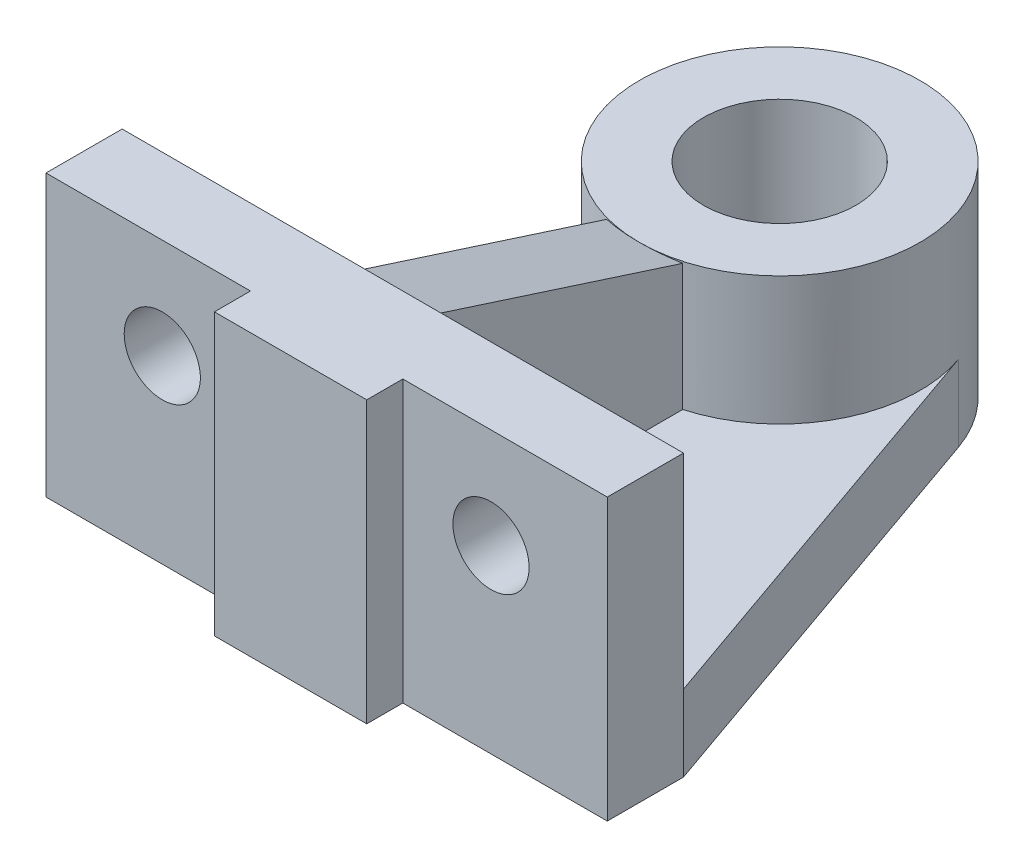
ISO-10303-21;
HEADER;
FILE_DESCRIPTION(('STEP AP214'),'2;1');
FILE_NAME('part.step','',(''),(''),'','','');
FILE_SCHEMA(('AUTOMOTIVE_DESIGN { 1 0 10303 214 1 1 1 1 }'));
ENDSEC;
DATA;
#1=APPLICATION_CONTEXT('core data for automotive mechanical design processes');
#2=APPLICATION_PROTOCOL_DEFINITION('international standard','automotive_design',2000,#1);
#3=PRODUCT_CONTEXT('',#1,'mechanical');
#4=PRODUCT('Part','Part','',(#3));
#5=PRODUCT_RELATED_PRODUCT_CATEGORY('part','',(#4));
#6=PRODUCT_DEFINITION_FORMATION('','',#4);
#7=PRODUCT_DEFINITION_CONTEXT('part definition',#1,'design');
#8=PRODUCT_DEFINITION('design','',#6,#7);
#9=PRODUCT_DEFINITION_SHAPE('','',#8);
#10=(LENGTH_UNIT() NAMED_UNIT(*) SI_UNIT(.MILLI.,.METRE.));
#11=(NAMED_UNIT(*) PLANE_ANGLE_UNIT() SI_UNIT($,.RADIAN.));
#12=(NAMED_UNIT(*) SI_UNIT($,.STERADIAN.) SOLID_ANGLE_UNIT());
#13=UNCERTAINTY_MEASURE_WITH_UNIT(LENGTH_MEASURE(1.E-05),#10,'distance_accuracy_value','');
#14=(GEOMETRIC_REPRESENTATION_CONTEXT(3) GLOBAL_UNCERTAINTY_ASSIGNED_CONTEXT((#13)) GLOBAL_UNIT_ASSIGNED_CONTEXT((#10,
#11,#12)) REPRESENTATION_CONTEXT('',''));
#15=CARTESIAN_POINT('',(0.,0.,0.));
#16=DIRECTION('',(0.,0.,1.));
#17=DIRECTION('',(1.,0.,0.));
#18=AXIS2_PLACEMENT_3D('',#15,#16,#17);
#19=CARTESIAN_POINT('',(0.,19.,0.));
#20=DIRECTION('',(0.,1.,0.));
#21=DIRECTION('',(0.,0.,1.));
#22=AXIS2_PLACEMENT_3D('',#19,#20,#21);
#23=PLANE('',#22);
#24=CARTESIAN_POINT('',(0.,19.,0.));
#25=DIRECTION('',(0.,1.,0.));
#26=DIRECTION('',(0.,0.,1.));
#27=AXIS2_PLACEMENT_3D('',#24,#25,#26);
#28=CIRCLE('',#27,35.);
#29=CARTESIAN_POINT('',(9.5,19.,33.686050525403));
#30=VERTEX_POINT('',#29);
#31=CARTESIAN_POINT('',(33.0332697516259,19.,-11.5673285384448));
#32=VERTEX_POINT('',#31);
#33=EDGE_CURVE('E44',#30,#32,#28,.T.);
#34=ORIENTED_EDGE('',*,*,#33,.F.);
#35=DIRECTION('',(0.,0.,-1.));
#36=VECTOR('',#35,1.);
#37=CARTESIAN_POINT('',(9.5,19.,35.));
#38=LINE('',#37,#36);
#39=CARTESIAN_POINT('',(9.49999999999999,19.,94.));
#40=VERTEX_POINT('',#39);
#41=EDGE_CURVE('E183',#40,#30,#38,.T.);
#42=ORIENTED_EDGE('',*,*,#41,.F.);
#43=DIRECTION('',(1.,0.,0.));
#44=VECTOR('',#43,1.);
#45=CARTESIAN_POINT('',(-70.,19.,94.));
#46=LINE('',#45,#44);
#47=CARTESIAN_POINT('',(70.,19.,94.));
#48=VERTEX_POINT('',#47);
#49=EDGE_CURVE('E233',#40,#48,#46,.T.);
#50=ORIENTED_EDGE('',*,*,#49,.T.);
#51=DIRECTION('',(-0.330495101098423,0.,-0.943807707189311));
#52=VECTOR('',#51,1.);
#53=CARTESIAN_POINT('',(70.,19.,94.));
#54=LINE('',#53,#52);
#55=EDGE_CURVE('E257',#48,#32,#54,.T.);
#56=ORIENTED_EDGE('',*,*,#55,.T.);
#57=EDGE_LOOP('',(#34,#42,#50,#56));
#58=FACE_BOUND('',#57,.T.);
#59=ADVANCED_FACE('F35',(#58),#23,.T.);
#60=CARTESIAN_POINT('',(0.,19.,0.));
#61=DIRECTION('',(0.,-1.,0.));
#62=DIRECTION('',(0.,0.,-1.));
#63=AXIS2_PLACEMENT_3D('',#60,#61,#62);
#64=CYLINDRICAL_SURFACE('',#63,35.);
#65=DIRECTION('',(0.,-1.,0.));
#66=VECTOR('',#65,1.);
#67=CARTESIAN_POINT('',(9.5,19.,33.6860505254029));
#68=LINE('',#67,#66);
#69=CARTESIAN_POINT('',(9.5,50.5768637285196,33.6860505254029));
#70=VERTEX_POINT('',#69);
#71=EDGE_CURVE('E191',#30,#70,#68,.F.);
#72=ORIENTED_EDGE('',*,*,#71,.F.);
#73=ORIENTED_EDGE('',*,*,#33,.T.);
#74=DIRECTION('',(0.,-1.,0.));
#75=VECTOR('',#74,1.);
#76=CARTESIAN_POINT('',(33.0332697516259,19.,-11.5673285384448));
#77=LINE('',#76,#75);
#78=CARTESIAN_POINT('',(33.0332697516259,0.,-11.5673285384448));
#79=VERTEX_POINT('',#78);
#80=EDGE_CURVE('E261',#32,#79,#77,.T.);
#81=ORIENTED_EDGE('',*,*,#80,.T.);
#82=CARTESIAN_POINT('',(0.,0.,0.));
#83=DIRECTION('',(0.,1.,0.));
#84=DIRECTION('',(0.,0.,1.));
#85=AXIS2_PLACEMENT_3D('',#82,#83,#84);
#86=CIRCLE('',#85,35.);
#87=CARTESIAN_POINT('',(-33.0332697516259,0.,-11.5673285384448));
#88=VERTEX_POINT('',#87);
#89=EDGE_CURVE('E254',#79,#88,#86,.T.);
#90=ORIENTED_EDGE('',*,*,#89,.T.);
#91=DIRECTION('',(0.,-1.,0.));
#92=VECTOR('',#91,1.);
#93=CARTESIAN_POINT('',(-33.0332697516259,19.,-11.5673285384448));
#94=LINE('',#93,#92);
#95=CARTESIAN_POINT('',(-33.0332697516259,19.,-11.5673285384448));
#96=VERTEX_POINT('',#95);
#97=EDGE_CURVE('E39',#96,#88,#94,.T.);
#98=ORIENTED_EDGE('',*,*,#97,.F.);
#99=CARTESIAN_POINT('',(-9.5,19.,33.686050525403));
#100=VERTEX_POINT('',#99);
#101=EDGE_CURVE('E11',#96,#100,#28,.T.);
#102=ORIENTED_EDGE('',*,*,#101,.T.);
#103=DIRECTION('',(0.,-1.,0.));
#104=VECTOR('',#103,1.);
#105=CARTESIAN_POINT('',(-9.5,19.,33.6860505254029));
#106=LINE('',#105,#104);
#107=CARTESIAN_POINT('',(-9.5,50.5768637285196,33.686050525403));
#108=VERTEX_POINT('',#107);
#109=EDGE_CURVE('E58',#100,#108,#106,.F.);
#110=ORIENTED_EDGE('',*,*,#109,.T.);
#111=CARTESIAN_POINT('',(0.,39.728813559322,0.));
#112=DIRECTION('',(0.,-0.951860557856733,0.306531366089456));
#113=DIRECTION('',(0.,-0.306531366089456,-0.951860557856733));
#114=AXIS2_PLACEMENT_3D('',#111,#112,#113);
#115=ELLIPSE('',#114,36.7700917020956,35.);
#116=CARTESIAN_POINT('',(0.,51.,35.));
#117=VERTEX_POINT('',#116);
#118=EDGE_CURVE('E177',#117,#108,#115,.T.);
#119=ORIENTED_EDGE('',*,*,#118,.F.);
#120=CARTESIAN_POINT('',(0.,51.,0.));
#121=DIRECTION('',(0.,1.,0.));
#122=DIRECTION('',(0.,0.,1.));
#123=AXIS2_PLACEMENT_3D('',#120,#121,#122);
#124=CIRCLE('',#123,35.);
#125=EDGE_CURVE('E248',#117,#117,#124,.T.);
#126=ORIENTED_EDGE('',*,*,#125,.F.);
#127=EDGE_CURVE('E52',#70,#117,#115,.T.);
#128=ORIENTED_EDGE('',*,*,#127,.F.);
#129=EDGE_LOOP('',(#72,#73,#81,#90,#98,#102,#110,#119,#126,#128));
#130=FACE_BOUND('',#129,.T.);
#131=ADVANCED_FACE('F37',(#130),#64,.T.);
#132=CARTESIAN_POINT('',(0.,0.,94.));
#133=DIRECTION('',(0.,0.,-1.));
#134=DIRECTION('',(-1.,0.,0.));
#135=AXIS2_PLACEMENT_3D('',#132,#133,#134);
#136=PLANE('',#135);
#137=CARTESIAN_POINT('',(41.,45.,94.));
#138=DIRECTION('',(0.,0.,-1.));
#139=DIRECTION('',(-1.,0.,0.));
#140=AXIS2_PLACEMENT_3D('',#137,#138,#139);
#141=CIRCLE('',#140,9.5);
#142=CARTESIAN_POINT('',(31.5,45.,94.));
#143=VERTEX_POINT('',#142);
#144=EDGE_CURVE('E198',#143,#143,#141,.T.);
#145=ORIENTED_EDGE('',*,*,#144,.F.);
#146=EDGE_LOOP('',(#145));
#147=FACE_BOUND('',#146,.T.);
#148=ORIENTED_EDGE('',*,*,#49,.F.);
#149=DIRECTION('',(0.,-1.,0.));
#150=VECTOR('',#149,1.);
#151=CARTESIAN_POINT('',(9.5,19.,94.));
#152=LINE('',#151,#150);
#153=CARTESIAN_POINT('',(9.49999999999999,70.,94.));
#154=VERTEX_POINT('',#153);
#155=EDGE_CURVE('E160',#154,#40,#152,.T.);
#156=ORIENTED_EDGE('',*,*,#155,.F.);
#157=DIRECTION('',(-1.,0.,0.));
#158=VECTOR('',#157,1.);
#159=CARTESIAN_POINT('',(-70.,70.,94.));
#160=LINE('',#159,#158);
#161=CARTESIAN_POINT('',(70.,70.,94.));
#162=VERTEX_POINT('',#161);
#163=EDGE_CURVE('E155',#162,#154,#160,.T.);
#164=ORIENTED_EDGE('',*,*,#163,.F.);
#165=DIRECTION('',(0.,1.,0.));
#166=VECTOR('',#165,1.);
#167=CARTESIAN_POINT('',(70.,19.,94.));
#168=LINE('',#167,#166);
#169=EDGE_CURVE('E172',#48,#162,#168,.T.);
#170=ORIENTED_EDGE('',*,*,#169,.F.);
#171=EDGE_LOOP('',(#148,#156,#164,#170));
#172=FACE_BOUND('',#171,.T.);
#173=ADVANCED_FACE('F306',(#147,#172),#136,.T.);
#174=CARTESIAN_POINT('',(-70.,19.,113.));
#175=DIRECTION('',(0.,0.,-1.));
#176=DIRECTION('',(-1.,0.,0.));
#177=AXIS2_PLACEMENT_3D('',#174,#175,#176);
#178=PLANE('',#177);
#179=CARTESIAN_POINT('',(41.,45.,113.));
#180=DIRECTION('',(0.,0.,-1.));
#181=DIRECTION('',(-1.,0.,0.));
#182=AXIS2_PLACEMENT_3D('',#179,#180,#181);
#183=CIRCLE('',#182,9.5);
#184=CARTESIAN_POINT('',(31.5,45.,113.));
#185=VERTEX_POINT('',#184);
#186=EDGE_CURVE('E194',#185,#185,#183,.T.);
#187=ORIENTED_EDGE('',*,*,#186,.T.);
#188=EDGE_LOOP('',(#187));
#189=FACE_BOUND('',#188,.T.);
#190=DIRECTION('',(0.,1.,0.));
#191=VECTOR('',#190,1.);
#192=CARTESIAN_POINT('',(19.,-39.0512483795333,113.));
#193=LINE('',#192,#191);
#194=CARTESIAN_POINT('',(19.,0.,113.));
#195=VERTEX_POINT('',#194);
#196=CARTESIAN_POINT('',(19.,70.,113.));
#197=VERTEX_POINT('',#196);
#198=EDGE_CURVE('E224',#195,#197,#193,.T.);
#199=ORIENTED_EDGE('',*,*,#198,.F.);
#200=DIRECTION('',(1.,0.,0.));
#201=VECTOR('',#200,1.);
#202=CARTESIAN_POINT('',(-70.,0.,113.));
#203=LINE('',#202,#201);
#204=CARTESIAN_POINT('',(70.,0.,113.));
#205=VERTEX_POINT('',#204);
#206=EDGE_CURVE('E268',#195,#205,#203,.T.);
#207=ORIENTED_EDGE('',*,*,#206,.T.);
#208=DIRECTION('',(0.,-1.,0.));
#209=VECTOR('',#208,1.);
#210=CARTESIAN_POINT('',(70.,19.,113.));
#211=LINE('',#210,#209);
#212=CARTESIAN_POINT('',(70.,70.,113.));
#213=VERTEX_POINT('',#212);
#214=EDGE_CURVE('E279',#213,#205,#211,.T.);
#215=ORIENTED_EDGE('',*,*,#214,.F.);
#216=DIRECTION('',(-1.,0.,0.));
#217=VECTOR('',#216,1.);
#218=CARTESIAN_POINT('',(-70.,70.,113.));
#219=LINE('',#218,#217);
#220=EDGE_CURVE('E234',#213,#197,#219,.T.);
#221=ORIENTED_EDGE('',*,*,#220,.T.);
#222=EDGE_LOOP('',(#199,#207,#215,#221));
#223=FACE_BOUND('',#222,.T.);
#224=ADVANCED_FACE('F340',(#189,#223),#178,.F.);
#225=DIRECTION('',(0.,0.,-1.));
#226=VECTOR('',#225,1.);
#227=CARTESIAN_POINT('',(-9.5,19.,19.));
#228=LINE('',#227,#226);
#229=CARTESIAN_POINT('',(-9.5,19.,94.));
#230=VERTEX_POINT('',#229);
#231=EDGE_CURVE('E179',#230,#100,#228,.T.);
#232=ORIENTED_EDGE('',*,*,#231,.T.);
#233=ORIENTED_EDGE('',*,*,#101,.F.);
#234=DIRECTION('',(-0.330495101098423,0.,0.943807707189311));
#235=VECTOR('',#234,1.);
#236=CARTESIAN_POINT('',(-70.,19.,94.));
#237=LINE('',#236,#235);
#238=CARTESIAN_POINT('',(-70.,19.,94.));
#239=VERTEX_POINT('',#238);
#240=EDGE_CURVE('E255',#96,#239,#237,.T.);
#241=ORIENTED_EDGE('',*,*,#240,.T.);
#242=EDGE_CURVE('E235',#239,#230,#46,.T.);
#243=ORIENTED_EDGE('',*,*,#242,.T.);
#244=EDGE_LOOP('',(#232,#233,#241,#243));
#245=FACE_BOUND('',#244,.T.);
#246=ADVANCED_FACE('F312',(#245),#23,.T.);
#247=CARTESIAN_POINT('',(0.,0.,0.));
#248=DIRECTION('',(0.,1.,0.));
#249=DIRECTION('',(0.,0.,1.));
#250=AXIS2_PLACEMENT_3D('',#247,#248,#249);
#251=PLANE('',#250);
#252=ORIENTED_EDGE('',*,*,#89,.F.);
#253=DIRECTION('',(-0.330495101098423,0.,-0.943807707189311));
#254=VECTOR('',#253,1.);
#255=CARTESIAN_POINT('',(70.,0.,94.));
#256=LINE('',#255,#254);
#257=CARTESIAN_POINT('',(70.,0.,94.));
#258=VERTEX_POINT('',#257);
#259=EDGE_CURVE('E258',#258,#79,#256,.T.);
#260=ORIENTED_EDGE('',*,*,#259,.F.);
#261=DIRECTION('',(0.,0.,-1.));
#262=VECTOR('',#261,1.);
#263=CARTESIAN_POINT('',(70.,0.,113.));
#264=LINE('',#263,#262);
#265=EDGE_CURVE('E271',#205,#258,#264,.T.);
#266=ORIENTED_EDGE('',*,*,#265,.F.);
#267=ORIENTED_EDGE('',*,*,#206,.F.);
#268=DIRECTION('',(0.,0.,1.));
#269=VECTOR('',#268,1.);
#270=CARTESIAN_POINT('',(19.,0.,113.));
#271=LINE('',#270,#269);
#272=CARTESIAN_POINT('',(19.,0.,122.));
#273=VERTEX_POINT('',#272);
#274=EDGE_CURVE('E213',#195,#273,#271,.T.);
#275=ORIENTED_EDGE('',*,*,#274,.T.);
#276=DIRECTION('',(-1.,0.,0.));
#277=VECTOR('',#276,1.);
#278=CARTESIAN_POINT('',(19.,0.,122.));
#279=LINE('',#278,#277);
#280=CARTESIAN_POINT('',(-19.,0.,122.));
#281=VERTEX_POINT('',#280);
#282=EDGE_CURVE('E210',#273,#281,#279,.T.);
#283=ORIENTED_EDGE('',*,*,#282,.T.);
#284=DIRECTION('',(0.,0.,-1.));
#285=VECTOR('',#284,1.);
#286=CARTESIAN_POINT('',(-19.,0.,113.));
#287=LINE('',#286,#285);
#288=CARTESIAN_POINT('',(-19.,0.,113.));
#289=VERTEX_POINT('',#288);
#290=EDGE_CURVE('E207',#281,#289,#287,.T.);
#291=ORIENTED_EDGE('',*,*,#290,.T.);
#292=CARTESIAN_POINT('',(-70.,0.,113.));
#293=VERTEX_POINT('',#292);
#294=EDGE_CURVE('E269',#293,#289,#203,.T.);
#295=ORIENTED_EDGE('',*,*,#294,.F.);
#296=DIRECTION('',(0.,0.,1.));
#297=VECTOR('',#296,1.);
#298=CARTESIAN_POINT('',(-70.,0.,113.));
#299=LINE('',#298,#297);
#300=CARTESIAN_POINT('',(-70.,0.,94.));
#301=VERTEX_POINT('',#300);
#302=EDGE_CURVE('E266',#301,#293,#299,.T.);
#303=ORIENTED_EDGE('',*,*,#302,.F.);
#304=DIRECTION('',(-0.330495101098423,0.,0.943807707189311));
#305=VECTOR('',#304,1.);
#306=CARTESIAN_POINT('',(-70.,0.,94.));
#307=LINE('',#306,#305);
#308=EDGE_CURVE('E264',#88,#301,#307,.T.);
#309=ORIENTED_EDGE('',*,*,#308,.F.);
#310=EDGE_LOOP('',(#252,#260,#266,#267,#275,#283,#291,#295,#303,#309));
#311=FACE_BOUND('',#310,.T.);
#312=CARTESIAN_POINT('',(0.,0.,0.));
#313=DIRECTION('',(0.,1.,0.));
#314=DIRECTION('',(0.,0.,1.));
#315=AXIS2_PLACEMENT_3D('',#312,#313,#314);
#316=CIRCLE('',#315,19.);
#317=CARTESIAN_POINT('',(0.,0.,19.));
#318=VERTEX_POINT('',#317);
#319=EDGE_CURVE('E250',#318,#318,#316,.T.);
#320=ORIENTED_EDGE('',*,*,#319,.T.);
#321=EDGE_LOOP('',(#320));
#322=FACE_BOUND('',#321,.T.);
#323=ADVANCED_FACE('F314',(#311,#322),#251,.F.);
#324=CARTESIAN_POINT('',(-70.,19.,94.));
#325=DIRECTION('',(0.943807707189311,0.,0.330495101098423));
#326=DIRECTION('',(0.330495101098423,0.,-0.943807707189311));
#327=AXIS2_PLACEMENT_3D('',#324,#325,#326);
#328=PLANE('',#327);
#329=ORIENTED_EDGE('',*,*,#308,.T.);
#330=DIRECTION('',(0.,-1.,0.));
#331=VECTOR('',#330,1.);
#332=CARTESIAN_POINT('',(-70.,19.,94.));
#333=LINE('',#332,#331);
#334=EDGE_CURVE('E284',#239,#301,#333,.T.);
#335=ORIENTED_EDGE('',*,*,#334,.F.);
#336=ORIENTED_EDGE('',*,*,#240,.F.);
#337=ORIENTED_EDGE('',*,*,#97,.T.);
#338=EDGE_LOOP('',(#329,#335,#336,#337));
#339=FACE_BOUND('',#338,.T.);
#340=ADVANCED_FACE('F318',(#339),#328,.F.);
#341=CARTESIAN_POINT('',(-70.,19.,113.));
#342=DIRECTION('',(1.,0.,0.));
#343=DIRECTION('',(0.,0.,-1.));
#344=AXIS2_PLACEMENT_3D('',#341,#342,#343);
#345=PLANE('',#344);
#346=ORIENTED_EDGE('',*,*,#302,.T.);
#347=DIRECTION('',(0.,-1.,0.));
#348=VECTOR('',#347,1.);
#349=CARTESIAN_POINT('',(-70.,19.,113.));
#350=LINE('',#349,#348);
#351=CARTESIAN_POINT('',(-70.,70.,113.));
#352=VERTEX_POINT('',#351);
#353=EDGE_CURVE('E282',#352,#293,#350,.T.);
#354=ORIENTED_EDGE('',*,*,#353,.F.);
#355=DIRECTION('',(0.,0.,1.));
#356=VECTOR('',#355,1.);
#357=CARTESIAN_POINT('',(-70.,70.,94.));
#358=LINE('',#357,#356);
#359=CARTESIAN_POINT('',(-70.,70.,94.));
#360=VERTEX_POINT('',#359);
#361=EDGE_CURVE('E241',#360,#352,#358,.T.);
#362=ORIENTED_EDGE('',*,*,#361,.F.);
#363=DIRECTION('',(0.,-1.,0.));
#364=VECTOR('',#363,1.);
#365=CARTESIAN_POINT('',(-70.,19.,94.));
#366=LINE('',#365,#364);
#367=EDGE_CURVE('E171',#360,#239,#366,.T.);
#368=ORIENTED_EDGE('',*,*,#367,.T.);
#369=ORIENTED_EDGE('',*,*,#334,.T.);
#370=EDGE_LOOP('',(#346,#354,#362,#368,#369));
#371=FACE_BOUND('',#370,.T.);
#372=ADVANCED_FACE('F319',(#371),#345,.F.);
#373=CARTESIAN_POINT('',(-41.,45.,113.));
#374=DIRECTION('',(0.,0.,-1.));
#375=DIRECTION('',(-1.,0.,0.));
#376=AXIS2_PLACEMENT_3D('',#373,#374,#375);
#377=CIRCLE('',#376,9.5);
#378=CARTESIAN_POINT('',(-50.5,45.,113.));
#379=VERTEX_POINT('',#378);
#380=EDGE_CURVE('E201',#379,#379,#377,.T.);
#381=ORIENTED_EDGE('',*,*,#380,.T.);
#382=EDGE_LOOP('',(#381));
#383=FACE_BOUND('',#382,.T.);
#384=ORIENTED_EDGE('',*,*,#294,.T.);
#385=DIRECTION('',(0.,1.,0.));
#386=VECTOR('',#385,1.);
#387=CARTESIAN_POINT('',(-19.,-39.0512483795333,113.));
#388=LINE('',#387,#386);
#389=CARTESIAN_POINT('',(-19.,70.,113.));
#390=VERTEX_POINT('',#389);
#391=EDGE_CURVE('E228',#289,#390,#388,.T.);
#392=ORIENTED_EDGE('',*,*,#391,.T.);
#393=EDGE_CURVE('E215',#390,#352,#219,.T.);
#394=ORIENTED_EDGE('',*,*,#393,.T.);
#395=ORIENTED_EDGE('',*,*,#353,.T.);
#396=EDGE_LOOP('',(#384,#392,#394,#395));
#397=FACE_BOUND('',#396,.T.);
#398=ADVANCED_FACE('F344',(#383,#397),#178,.F.);
#399=CARTESIAN_POINT('',(70.,19.,113.));
#400=DIRECTION('',(-1.,0.,0.));
#401=DIRECTION('',(0.,0.,1.));
#402=AXIS2_PLACEMENT_3D('',#399,#400,#401);
#403=PLANE('',#402);
#404=ORIENTED_EDGE('',*,*,#265,.T.);
#405=DIRECTION('',(0.,-1.,0.));
#406=VECTOR('',#405,1.);
#407=CARTESIAN_POINT('',(70.,19.,94.));
#408=LINE('',#407,#406);
#409=EDGE_CURVE('E276',#48,#258,#408,.T.);
#410=ORIENTED_EDGE('',*,*,#409,.F.);
#411=ORIENTED_EDGE('',*,*,#169,.T.);
#412=DIRECTION('',(0.,0.,1.));
#413=VECTOR('',#412,1.);
#414=CARTESIAN_POINT('',(70.,70.,94.));
#415=LINE('',#414,#413);
#416=EDGE_CURVE('E239',#162,#213,#415,.T.);
#417=ORIENTED_EDGE('',*,*,#416,.T.);
#418=ORIENTED_EDGE('',*,*,#214,.T.);
#419=EDGE_LOOP('',(#404,#410,#411,#417,#418));
#420=FACE_BOUND('',#419,.T.);
#421=ADVANCED_FACE('F342',(#420),#403,.F.);
#422=CARTESIAN_POINT('',(70.,19.,94.));
#423=DIRECTION('',(-0.943807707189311,0.,0.330495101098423));
#424=DIRECTION('',(0.330495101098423,0.,0.943807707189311));
#425=AXIS2_PLACEMENT_3D('',#422,#423,#424);
#426=PLANE('',#425);
#427=ORIENTED_EDGE('',*,*,#259,.T.);
#428=ORIENTED_EDGE('',*,*,#80,.F.);
#429=ORIENTED_EDGE('',*,*,#55,.F.);
#430=ORIENTED_EDGE('',*,*,#409,.T.);
#431=EDGE_LOOP('',(#427,#428,#429,#430));
#432=FACE_BOUND('',#431,.T.);
#433=ADVANCED_FACE('F299',(#432),#426,.F.);
#434=CARTESIAN_POINT('',(0.,19.,0.));
#435=DIRECTION('',(0.,-1.,0.));
#436=DIRECTION('',(0.,0.,-1.));
#437=AXIS2_PLACEMENT_3D('',#434,#435,#436);
#438=CYLINDRICAL_SURFACE('',#437,19.);
#439=ORIENTED_EDGE('',*,*,#319,.F.);
#440=EDGE_LOOP('',(#439));
#441=FACE_BOUND('',#440,.T.);
#442=CARTESIAN_POINT('',(0.,51.,0.));
#443=DIRECTION('',(0.,1.,0.));
#444=DIRECTION('',(0.,0.,1.));
#445=AXIS2_PLACEMENT_3D('',#442,#443,#444);
#446=CIRCLE('',#445,19.);
#447=CARTESIAN_POINT('',(0.,51.,19.));
#448=VERTEX_POINT('',#447);
#449=EDGE_CURVE('E243',#448,#448,#446,.T.);
#450=ORIENTED_EDGE('',*,*,#449,.T.);
#451=EDGE_LOOP('',(#450));
#452=FACE_BOUND('',#451,.T.);
#453=ADVANCED_FACE('F350',(#441,#452),#438,.F.);
#454=CARTESIAN_POINT('',(0.,51.,0.));
#455=DIRECTION('',(0.,1.,0.));
#456=DIRECTION('',(0.,0.,1.));
#457=AXIS2_PLACEMENT_3D('',#454,#455,#456);
#458=PLANE('',#457);
#459=ORIENTED_EDGE('',*,*,#125,.T.);
#460=EDGE_LOOP('',(#459));
#461=FACE_BOUND('',#460,.T.);
#462=ORIENTED_EDGE('',*,*,#449,.F.);
#463=EDGE_LOOP('',(#462));
#464=FACE_BOUND('',#463,.T.);
#465=ADVANCED_FACE('F448',(#461,#464),#458,.T.);
#466=CARTESIAN_POINT('',(-70.,70.,94.));
#467=DIRECTION('',(0.,1.,0.));
#468=DIRECTION('',(0.,0.,1.));
#469=AXIS2_PLACEMENT_3D('',#466,#467,#468);
#470=PLANE('',#469);
#471=ORIENTED_EDGE('',*,*,#220,.F.);
#472=ORIENTED_EDGE('',*,*,#416,.F.);
#473=ORIENTED_EDGE('',*,*,#163,.T.);
#474=DIRECTION('',(-1.,0.,0.));
#475=VECTOR('',#474,1.);
#476=CARTESIAN_POINT('',(9.5,70.,94.));
#477=LINE('',#476,#475);
#478=CARTESIAN_POINT('',(-9.5,70.,94.));
#479=VERTEX_POINT('',#478);
#480=EDGE_CURVE('E147',#154,#479,#477,.T.);
#481=ORIENTED_EDGE('',*,*,#480,.T.);
#482=EDGE_CURVE('E152',#479,#360,#160,.T.);
#483=ORIENTED_EDGE('',*,*,#482,.T.);
#484=ORIENTED_EDGE('',*,*,#361,.T.);
#485=ORIENTED_EDGE('',*,*,#393,.F.);
#486=DIRECTION('',(0.,0.,1.));
#487=VECTOR('',#486,1.);
#488=CARTESIAN_POINT('',(-19.,70.,113.));
#489=LINE('',#488,#487);
#490=CARTESIAN_POINT('',(-19.,70.,122.));
#491=VERTEX_POINT('',#490);
#492=EDGE_CURVE('E218',#390,#491,#489,.T.);
#493=ORIENTED_EDGE('',*,*,#492,.T.);
#494=DIRECTION('',(1.,0.,0.));
#495=VECTOR('',#494,1.);
#496=CARTESIAN_POINT('',(19.,70.,122.));
#497=LINE('',#496,#495);
#498=CARTESIAN_POINT('',(19.,70.,122.));
#499=VERTEX_POINT('',#498);
#500=EDGE_CURVE('E221',#491,#499,#497,.T.);
#501=ORIENTED_EDGE('',*,*,#500,.T.);
#502=DIRECTION('',(0.,0.,-1.));
#503=VECTOR('',#502,1.);
#504=CARTESIAN_POINT('',(19.,70.,113.));
#505=LINE('',#504,#503);
#506=EDGE_CURVE('E197',#499,#197,#505,.T.);
#507=ORIENTED_EDGE('',*,*,#506,.T.);
#508=EDGE_LOOP('',(#471,#472,#473,#481,#483,#484,#485,#493,#501,#507));
#509=FACE_BOUND('',#508,.T.);
#510=ADVANCED_FACE('F150',(#509),#470,.T.);
#511=DIRECTION('',(0.,-1.,0.));
#512=VECTOR('',#511,1.);
#513=CARTESIAN_POINT('',(-9.5,19.,94.));
#514=LINE('',#513,#512);
#515=EDGE_CURVE('E168',#479,#230,#514,.T.);
#516=ORIENTED_EDGE('',*,*,#515,.T.);
#517=ORIENTED_EDGE('',*,*,#242,.F.);
#518=ORIENTED_EDGE('',*,*,#367,.F.);
#519=ORIENTED_EDGE('',*,*,#482,.F.);
#520=EDGE_LOOP('',(#516,#517,#518,#519));
#521=FACE_BOUND('',#520,.T.);
#522=CARTESIAN_POINT('',(-41.,45.,94.));
#523=DIRECTION('',(0.,0.,-1.));
#524=DIRECTION('',(-1.,0.,0.));
#525=AXIS2_PLACEMENT_3D('',#522,#523,#524);
#526=CIRCLE('',#525,9.5);
#527=CARTESIAN_POINT('',(-50.5,45.,94.));
#528=VERTEX_POINT('',#527);
#529=EDGE_CURVE('E204',#528,#528,#526,.T.);
#530=ORIENTED_EDGE('',*,*,#529,.F.);
#531=EDGE_LOOP('',(#530));
#532=FACE_BOUND('',#531,.T.);
#533=ADVANCED_FACE('F164',(#521,#532),#136,.T.);
#534=CARTESIAN_POINT('',(19.,-39.0512483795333,113.));
#535=DIRECTION('',(1.,0.,0.));
#536=DIRECTION('',(0.,0.,-1.));
#537=AXIS2_PLACEMENT_3D('',#534,#535,#536);
#538=PLANE('',#537);
#539=ORIENTED_EDGE('',*,*,#274,.F.);
#540=ORIENTED_EDGE('',*,*,#198,.T.);
#541=ORIENTED_EDGE('',*,*,#506,.F.);
#542=DIRECTION('',(0.,1.,0.));
#543=VECTOR('',#542,1.);
#544=CARTESIAN_POINT('',(19.,-39.0512483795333,122.));
#545=LINE('',#544,#543);
#546=EDGE_CURVE('E211',#273,#499,#545,.T.);
#547=ORIENTED_EDGE('',*,*,#546,.F.);
#548=EDGE_LOOP('',(#539,#540,#541,#547));
#549=FACE_BOUND('',#548,.T.);
#550=ADVANCED_FACE('F337',(#549),#538,.T.);
#551=CARTESIAN_POINT('',(19.,-39.0512483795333,122.));
#552=DIRECTION('',(0.,0.,1.));
#553=DIRECTION('',(1.,0.,0.));
#554=AXIS2_PLACEMENT_3D('',#551,#552,#553);
#555=PLANE('',#554);
#556=ORIENTED_EDGE('',*,*,#282,.F.);
#557=ORIENTED_EDGE('',*,*,#546,.T.);
#558=ORIENTED_EDGE('',*,*,#500,.F.);
#559=DIRECTION('',(0.,1.,0.));
#560=VECTOR('',#559,1.);
#561=CARTESIAN_POINT('',(-19.,-39.0512483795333,122.));
#562=LINE('',#561,#560);
#563=EDGE_CURVE('E226',#281,#491,#562,.T.);
#564=ORIENTED_EDGE('',*,*,#563,.F.);
#565=EDGE_LOOP('',(#556,#557,#558,#564));
#566=FACE_BOUND('',#565,.T.);
#567=ADVANCED_FACE('F332',(#566),#555,.T.);
#568=CARTESIAN_POINT('',(-19.,-39.0512483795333,113.));
#569=DIRECTION('',(-1.,0.,0.));
#570=DIRECTION('',(0.,0.,1.));
#571=AXIS2_PLACEMENT_3D('',#568,#569,#570);
#572=PLANE('',#571);
#573=ORIENTED_EDGE('',*,*,#290,.F.);
#574=ORIENTED_EDGE('',*,*,#563,.T.);
#575=ORIENTED_EDGE('',*,*,#492,.F.);
#576=ORIENTED_EDGE('',*,*,#391,.F.);
#577=EDGE_LOOP('',(#573,#574,#575,#576));
#578=FACE_BOUND('',#577,.T.);
#579=ADVANCED_FACE('F328',(#578),#572,.T.);
#580=CARTESIAN_POINT('',(-41.,45.,113.));
#581=DIRECTION('',(0.,0.,-1.));
#582=DIRECTION('',(-1.,0.,0.));
#583=AXIS2_PLACEMENT_3D('',#580,#581,#582);
#584=CYLINDRICAL_SURFACE('',#583,9.5);
#585=ORIENTED_EDGE('',*,*,#380,.F.);
#586=EDGE_LOOP('',(#585));
#587=FACE_BOUND('',#586,.T.);
#588=ORIENTED_EDGE('',*,*,#529,.T.);
#589=EDGE_LOOP('',(#588));
#590=FACE_BOUND('',#589,.T.);
#591=ADVANCED_FACE('F398',(#587,#590),#584,.F.);
#592=CARTESIAN_POINT('',(41.,45.,113.));
#593=DIRECTION('',(0.,0.,-1.));
#594=DIRECTION('',(-1.,0.,0.));
#595=AXIS2_PLACEMENT_3D('',#592,#593,#594);
#596=CYLINDRICAL_SURFACE('',#595,9.5);
#597=ORIENTED_EDGE('',*,*,#186,.F.);
#598=EDGE_LOOP('',(#597));
#599=FACE_BOUND('',#598,.T.);
#600=ORIENTED_EDGE('',*,*,#144,.T.);
#601=EDGE_LOOP('',(#600));
#602=FACE_BOUND('',#601,.T.);
#603=ADVANCED_FACE('F403',(#599,#602),#596,.F.);
#604=CARTESIAN_POINT('',(9.5,70.,94.));
#605=DIRECTION('',(0.,-0.951860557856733,0.306531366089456));
#606=DIRECTION('',(0.,-0.306531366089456,-0.951860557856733));
#607=AXIS2_PLACEMENT_3D('',#604,#605,#606);
#608=PLANE('',#607);
#609=DIRECTION('',(0.,0.306531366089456,0.951860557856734));
#610=VECTOR('',#609,1.);
#611=CARTESIAN_POINT('',(9.5,51.,35.));
#612=LINE('',#611,#610);
#613=EDGE_CURVE('E186',#70,#154,#612,.T.);
#614=ORIENTED_EDGE('',*,*,#613,.F.);
#615=ORIENTED_EDGE('',*,*,#127,.T.);
#616=ORIENTED_EDGE('',*,*,#118,.T.);
#617=DIRECTION('',(0.,0.306531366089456,0.951860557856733));
#618=VECTOR('',#617,1.);
#619=CARTESIAN_POINT('',(-9.5,70.,94.));
#620=LINE('',#619,#618);
#621=EDGE_CURVE('E175',#108,#479,#620,.T.);
#622=ORIENTED_EDGE('',*,*,#621,.T.);
#623=ORIENTED_EDGE('',*,*,#480,.F.);
#624=EDGE_LOOP('',(#614,#615,#616,#622,#623));
#625=FACE_BOUND('',#624,.T.);
#626=ADVANCED_FACE('F176',(#625),#608,.F.);
#627=CARTESIAN_POINT('',(9.5,0.,0.));
#628=DIRECTION('',(-1.,0.,0.));
#629=DIRECTION('',(0.,0.,1.));
#630=AXIS2_PLACEMENT_3D('',#627,#628,#629);
#631=PLANE('',#630);
#632=ORIENTED_EDGE('',*,*,#41,.T.);
#633=ORIENTED_EDGE('',*,*,#71,.T.);
#634=ORIENTED_EDGE('',*,*,#613,.T.);
#635=ORIENTED_EDGE('',*,*,#155,.T.);
#636=EDGE_LOOP('',(#632,#633,#634,#635));
#637=FACE_BOUND('',#636,.T.);
#638=ADVANCED_FACE('F308',(#637),#631,.F.);
#639=CARTESIAN_POINT('',(-9.5,0.,0.));
#640=DIRECTION('',(-1.,0.,0.));
#641=DIRECTION('',(0.,0.,1.));
#642=AXIS2_PLACEMENT_3D('',#639,#640,#641);
#643=PLANE('',#642);
#644=ORIENTED_EDGE('',*,*,#109,.F.);
#645=ORIENTED_EDGE('',*,*,#231,.F.);
#646=ORIENTED_EDGE('',*,*,#515,.F.);
#647=ORIENTED_EDGE('',*,*,#621,.F.);
#648=EDGE_LOOP('',(#644,#645,#646,#647));
#649=FACE_BOUND('',#648,.T.);
#650=ADVANCED_FACE('F182',(#649),#643,.T.);
#651=CLOSED_SHELL('',(#59,#131,#173,#224,#246,#323,#340,#372,#398,#421,#433,#453,#465,#510,#533,
#550,#567,#579,#591,#603,#626,#638,#650));
#652=MANIFOLD_SOLID_BREP('B2',#651);
#653=ADVANCED_BREP_SHAPE_REPRESENTATION('',(#18,#652),#14);
#654=SHAPE_DEFINITION_REPRESENTATION(#9,#653);
ENDSEC;
END-ISO-10303-21;
